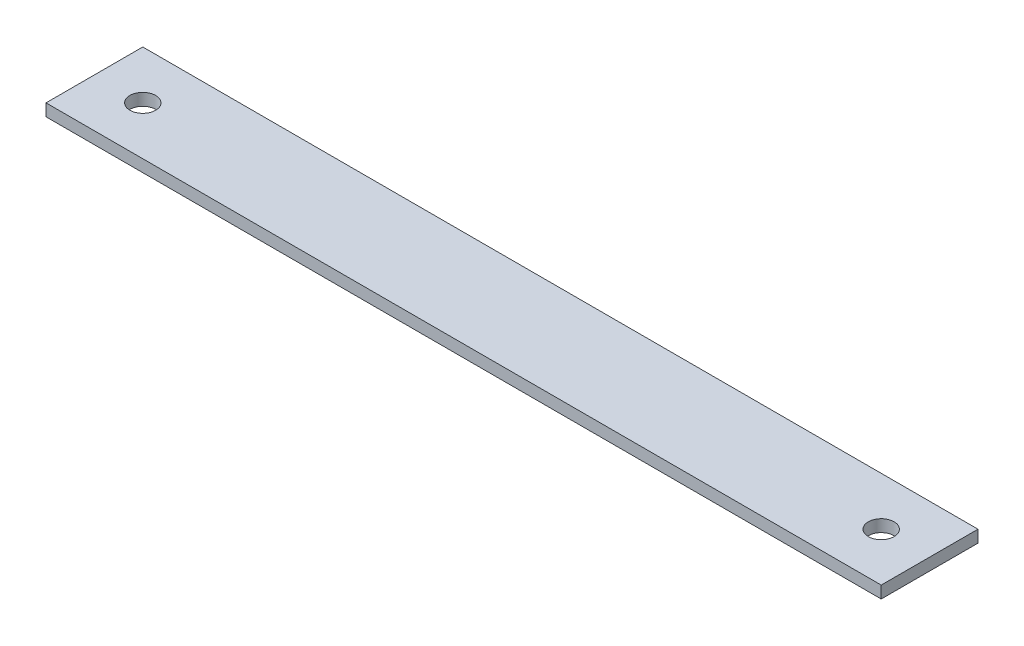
from build123d import *

# Parameters (mm, degrees)
SKETCH1_W           = 219.202
SKETCH1_H           = 25.4
BOSS_EXTRUDE1_DEPTH = 3.175
SKETCH3_R           = 3.3782
CUT_EXTRUDE1_DEPTH  = 111.380024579


with BuildPart() as part:
    # Sketch1 → Boss-Extrude1 (new body)
    with BuildSketch(Plane(origin=(0, 0, 0), x_dir=(1, 0, 0), z_dir=(0, 1, 0))):
        Rectangle(SKETCH1_W, SKETCH1_H)
    extrude(amount=BOSS_EXTRUDE1_DEPTH)

    # Sketch3 → Cut-Extrude1 (cut, through all)
    with BuildSketch(Plane(origin=(0, 3.175, 0), x_dir=(1, 0, 0), z_dir=(0, 1, 0))):
        with Locations(Location((-96.901, 0, 0), (0, 0, 270))):
            Circle(SKETCH3_R)
        with Locations(Location((96.901, 0, 0), (0, 0, 270))):
            Circle(SKETCH3_R)
    extrude(amount=-CUT_EXTRUDE1_DEPTH, mode=Mode.SUBTRACT)


solid = part.part
